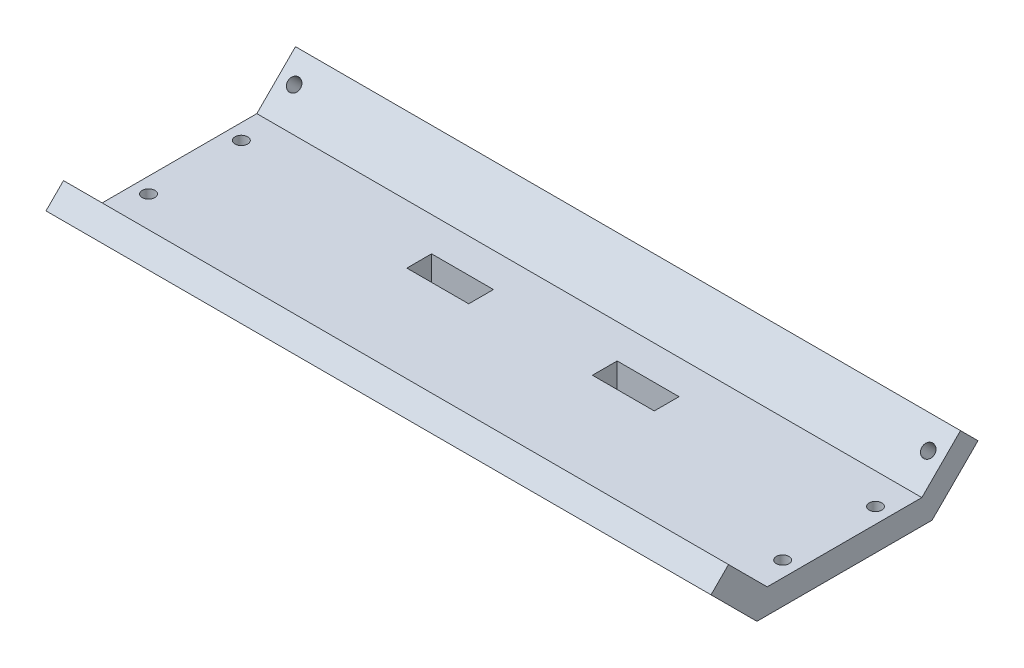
ISO-10303-21;
HEADER;
FILE_DESCRIPTION(('STEP AP214'),'2;1');
FILE_NAME('part.step','',(''),(''),'','','');
FILE_SCHEMA(('AUTOMOTIVE_DESIGN { 1 0 10303 214 1 1 1 1 }'));
ENDSEC;
DATA;
#1=APPLICATION_CONTEXT('core data for automotive mechanical design processes');
#2=APPLICATION_PROTOCOL_DEFINITION('international standard','automotive_design',2000,#1);
#3=PRODUCT_CONTEXT('',#1,'mechanical');
#4=PRODUCT('Part','Part','',(#3));
#5=PRODUCT_RELATED_PRODUCT_CATEGORY('part','',(#4));
#6=PRODUCT_DEFINITION_FORMATION('','',#4);
#7=PRODUCT_DEFINITION_CONTEXT('part definition',#1,'design');
#8=PRODUCT_DEFINITION('design','',#6,#7);
#9=PRODUCT_DEFINITION_SHAPE('','',#8);
#10=(LENGTH_UNIT() NAMED_UNIT(*) SI_UNIT(.MILLI.,.METRE.));
#11=(NAMED_UNIT(*) PLANE_ANGLE_UNIT() SI_UNIT($,.RADIAN.));
#12=(NAMED_UNIT(*) SI_UNIT($,.STERADIAN.) SOLID_ANGLE_UNIT());
#13=UNCERTAINTY_MEASURE_WITH_UNIT(LENGTH_MEASURE(1.E-05),#10,'distance_accuracy_value','');
#14=(GEOMETRIC_REPRESENTATION_CONTEXT(3) GLOBAL_UNCERTAINTY_ASSIGNED_CONTEXT((#13)) GLOBAL_UNIT_ASSIGNED_CONTEXT((#10,
#11,#12)) REPRESENTATION_CONTEXT('',''));
#15=CARTESIAN_POINT('',(0.,0.,0.));
#16=DIRECTION('',(0.,0.,1.));
#17=DIRECTION('',(1.,0.,0.));
#18=AXIS2_PLACEMENT_3D('',#15,#16,#17);
#19=CARTESIAN_POINT('',(107.5,12.4999999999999,37.5000000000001));
#20=DIRECTION('',(0.,-0.707106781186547,-0.707106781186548));
#21=DIRECTION('',(0.,0.707106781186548,-0.707106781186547));
#22=AXIS2_PLACEMENT_3D('',#19,#20,#21);
#23=PLANE('',#22);
#24=DIRECTION('',(0.,-0.707106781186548,0.707106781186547));
#25=VECTOR('',#24,1.);
#26=CARTESIAN_POINT('',(-107.5,12.4999999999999,37.5000000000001));
#27=LINE('',#26,#25);
#28=CARTESIAN_POINT('',(-107.5,12.4999999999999,37.5000000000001));
#29=VERTEX_POINT('',#28);
#30=CARTESIAN_POINT('',(-107.5,6.84314575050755,43.1568542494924));
#31=VERTEX_POINT('',#30);
#32=EDGE_CURVE('E266',#29,#31,#27,.T.);
#33=ORIENTED_EDGE('',*,*,#32,.T.);
#34=DIRECTION('',(-1.,0.,0.));
#35=VECTOR('',#34,1.);
#36=CARTESIAN_POINT('',(107.5,6.84314575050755,43.1568542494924));
#37=LINE('',#36,#35);
#38=CARTESIAN_POINT('',(107.5,6.84314575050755,43.1568542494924));
#39=VERTEX_POINT('',#38);
#40=EDGE_CURVE('E11',#39,#31,#37,.T.);
#41=ORIENTED_EDGE('',*,*,#40,.F.);
#42=DIRECTION('',(0.,-0.707106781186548,0.707106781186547));
#43=VECTOR('',#42,1.);
#44=CARTESIAN_POINT('',(107.5,12.4999999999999,37.5000000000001));
#45=LINE('',#44,#43);
#46=CARTESIAN_POINT('',(107.5,12.4999999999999,37.5000000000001));
#47=VERTEX_POINT('',#46);
#48=EDGE_CURVE('E267',#47,#39,#45,.T.);
#49=ORIENTED_EDGE('',*,*,#48,.F.);
#50=DIRECTION('',(-1.,0.,0.));
#51=VECTOR('',#50,1.);
#52=CARTESIAN_POINT('',(107.5,12.4999999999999,37.5000000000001));
#53=LINE('',#52,#51);
#54=EDGE_CURVE('E285',#47,#29,#53,.T.);
#55=ORIENTED_EDGE('',*,*,#54,.T.);
#56=EDGE_LOOP('',(#33,#41,#49,#55));
#57=FACE_BOUND('',#56,.T.);
#58=ADVANCED_FACE('F38',(#57),#23,.F.);
#59=CARTESIAN_POINT('',(107.5,-8.,28.313708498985));
#60=DIRECTION('',(0.,0.707106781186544,-0.707106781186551));
#61=DIRECTION('',(0.,0.707106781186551,0.707106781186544));
#62=AXIS2_PLACEMENT_3D('',#59,#60,#61);
#63=PLANE('',#62);
#64=CARTESIAN_POINT('',(-102.5,1.414213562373,37.7279220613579));
#65=DIRECTION('',(0.,0.707106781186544,-0.707106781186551));
#66=DIRECTION('',(0.,0.707106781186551,0.707106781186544));
#67=AXIS2_PLACEMENT_3D('',#64,#65,#66);
#68=CIRCLE('',#67,2.04999999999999);
#69=CARTESIAN_POINT('',(-102.5,2.86378246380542,39.1774909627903));
#70=VERTEX_POINT('',#69);
#71=EDGE_CURVE('E242',#70,#70,#68,.T.);
#72=ORIENTED_EDGE('',*,*,#71,.T.);
#73=EDGE_LOOP('',(#72));
#74=FACE_BOUND('',#73,.T.);
#75=CARTESIAN_POINT('',(102.5,1.414213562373,37.7279220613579));
#76=DIRECTION('',(0.,0.707106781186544,-0.707106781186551));
#77=DIRECTION('',(0.,0.707106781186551,0.707106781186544));
#78=AXIS2_PLACEMENT_3D('',#75,#76,#77);
#79=CIRCLE('',#78,2.04999999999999);
#80=CARTESIAN_POINT('',(102.5,2.86378246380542,39.1774909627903));
#81=VERTEX_POINT('',#80);
#82=EDGE_CURVE('E41',#81,#81,#79,.T.);
#83=ORIENTED_EDGE('',*,*,#82,.T.);
#84=EDGE_LOOP('',(#83));
#85=FACE_BOUND('',#84,.T.);
#86=DIRECTION('',(0.,-0.707106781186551,-0.707106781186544));
#87=VECTOR('',#86,1.);
#88=CARTESIAN_POINT('',(-107.5,-8.,28.313708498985));
#89=LINE('',#88,#87);
#90=CARTESIAN_POINT('',(-107.5,-8.,28.313708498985));
#91=VERTEX_POINT('',#90);
#92=EDGE_CURVE('E288',#31,#91,#89,.T.);
#93=ORIENTED_EDGE('',*,*,#92,.T.);
#94=DIRECTION('',(-1.,0.,0.));
#95=VECTOR('',#94,1.);
#96=CARTESIAN_POINT('',(107.5,-8.,28.313708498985));
#97=LINE('',#96,#95);
#98=CARTESIAN_POINT('',(107.5,-8.,28.313708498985));
#99=VERTEX_POINT('',#98);
#100=EDGE_CURVE('E46',#99,#91,#97,.T.);
#101=ORIENTED_EDGE('',*,*,#100,.F.);
#102=DIRECTION('',(0.,-0.707106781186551,-0.707106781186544));
#103=VECTOR('',#102,1.);
#104=CARTESIAN_POINT('',(107.5,-8.,28.313708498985));
#105=LINE('',#104,#103);
#106=EDGE_CURVE('E270',#39,#99,#105,.T.);
#107=ORIENTED_EDGE('',*,*,#106,.F.);
#108=ORIENTED_EDGE('',*,*,#40,.T.);
#109=EDGE_LOOP('',(#93,#101,#107,#108));
#110=FACE_BOUND('',#109,.T.);
#111=ADVANCED_FACE('F345',(#74,#85,#110),#63,.F.);
#112=CARTESIAN_POINT('',(107.5,-8.,28.313708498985));
#113=DIRECTION('',(0.,1.,0.));
#114=DIRECTION('',(0.,0.,1.));
#115=AXIS2_PLACEMENT_3D('',#112,#113,#114);
#116=PLANE('',#115);
#117=DIRECTION('',(1.,0.,0.));
#118=VECTOR('',#117,1.);
#119=CARTESIAN_POINT('',(20.,-8.,-6.));
#120=LINE('',#119,#118);
#121=CARTESIAN_POINT('',(20.,-8.,-6.));
#122=VERTEX_POINT('',#121);
#123=CARTESIAN_POINT('',(40.,-8.,-6.));
#124=VERTEX_POINT('',#123);
#125=EDGE_CURVE('E163',#122,#124,#120,.T.);
#126=ORIENTED_EDGE('',*,*,#125,.T.);
#127=DIRECTION('',(0.,0.,-1.));
#128=VECTOR('',#127,1.);
#129=CARTESIAN_POINT('',(40.,-8.,-14.));
#130=LINE('',#129,#128);
#131=CARTESIAN_POINT('',(40.,-8.,-14.));
#132=VERTEX_POINT('',#131);
#133=EDGE_CURVE('E155',#124,#132,#130,.T.);
#134=ORIENTED_EDGE('',*,*,#133,.T.);
#135=DIRECTION('',(-1.,0.,0.));
#136=VECTOR('',#135,1.);
#137=CARTESIAN_POINT('',(20.,-8.,-14.));
#138=LINE('',#137,#136);
#139=CARTESIAN_POINT('',(20.,-8.,-14.));
#140=VERTEX_POINT('',#139);
#141=EDGE_CURVE('E166',#132,#140,#138,.T.);
#142=ORIENTED_EDGE('',*,*,#141,.T.);
#143=DIRECTION('',(0.,0.,1.));
#144=VECTOR('',#143,1.);
#145=CARTESIAN_POINT('',(20.,-8.,-14.));
#146=LINE('',#145,#144);
#147=EDGE_CURVE('E53',#140,#122,#146,.T.);
#148=ORIENTED_EDGE('',*,*,#147,.T.);
#149=EDGE_LOOP('',(#126,#134,#142,#148));
#150=FACE_BOUND('',#149,.T.);
#151=DIRECTION('',(1.,0.,0.));
#152=VECTOR('',#151,1.);
#153=CARTESIAN_POINT('',(-40.,-8.,-6.));
#154=LINE('',#153,#152);
#155=CARTESIAN_POINT('',(-40.,-8.,-6.));
#156=VERTEX_POINT('',#155);
#157=CARTESIAN_POINT('',(-20.,-8.,-6.));
#158=VERTEX_POINT('',#157);
#159=EDGE_CURVE('E196',#156,#158,#154,.T.);
#160=ORIENTED_EDGE('',*,*,#159,.T.);
#161=DIRECTION('',(0.,0.,-1.));
#162=VECTOR('',#161,1.);
#163=CARTESIAN_POINT('',(-20.,-8.,-14.));
#164=LINE('',#163,#162);
#165=CARTESIAN_POINT('',(-20.,-8.,-14.));
#166=VERTEX_POINT('',#165);
#167=EDGE_CURVE('E207',#158,#166,#164,.T.);
#168=ORIENTED_EDGE('',*,*,#167,.T.);
#169=DIRECTION('',(-1.,0.,0.));
#170=VECTOR('',#169,1.);
#171=CARTESIAN_POINT('',(-40.,-8.,-14.));
#172=LINE('',#171,#170);
#173=CARTESIAN_POINT('',(-40.,-8.,-14.));
#174=VERTEX_POINT('',#173);
#175=EDGE_CURVE('E217',#166,#174,#172,.T.);
#176=ORIENTED_EDGE('',*,*,#175,.T.);
#177=DIRECTION('',(0.,0.,1.));
#178=VECTOR('',#177,1.);
#179=CARTESIAN_POINT('',(-40.,-8.,-14.));
#180=LINE('',#179,#178);
#181=EDGE_CURVE('E61',#174,#156,#180,.T.);
#182=ORIENTED_EDGE('',*,*,#181,.T.);
#183=EDGE_LOOP('',(#160,#168,#176,#182));
#184=FACE_BOUND('',#183,.T.);
#185=CARTESIAN_POINT('',(-102.5,-8.,-15.0000000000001));
#186=DIRECTION('',(0.,1.,0.));
#187=DIRECTION('',(0.,0.,1.));
#188=AXIS2_PLACEMENT_3D('',#185,#186,#187);
#189=CIRCLE('',#188,2.05);
#190=CARTESIAN_POINT('',(-102.5,-8.,-12.9500000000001));
#191=VERTEX_POINT('',#190);
#192=EDGE_CURVE('E230',#191,#191,#189,.T.);
#193=ORIENTED_EDGE('',*,*,#192,.T.);
#194=EDGE_LOOP('',(#193));
#195=FACE_BOUND('',#194,.T.);
#196=CARTESIAN_POINT('',(-102.5,-8.,15.0000000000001));
#197=DIRECTION('',(0.,1.,0.));
#198=DIRECTION('',(0.,0.,1.));
#199=AXIS2_PLACEMENT_3D('',#196,#197,#198);
#200=CIRCLE('',#199,2.05);
#201=CARTESIAN_POINT('',(-102.5,-8.,17.0500000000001));
#202=VERTEX_POINT('',#201);
#203=EDGE_CURVE('E236',#202,#202,#200,.T.);
#204=ORIENTED_EDGE('',*,*,#203,.T.);
#205=EDGE_LOOP('',(#204));
#206=FACE_BOUND('',#205,.T.);
#207=CARTESIAN_POINT('',(102.5,-8.,15.0000000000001));
#208=DIRECTION('',(0.,1.,0.));
#209=DIRECTION('',(0.,0.,1.));
#210=AXIS2_PLACEMENT_3D('',#207,#208,#209);
#211=CIRCLE('',#210,2.05);
#212=CARTESIAN_POINT('',(102.5,-8.,17.0500000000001));
#213=VERTEX_POINT('',#212);
#214=EDGE_CURVE('E251',#213,#213,#211,.T.);
#215=ORIENTED_EDGE('',*,*,#214,.T.);
#216=EDGE_LOOP('',(#215));
#217=FACE_BOUND('',#216,.T.);
#218=CARTESIAN_POINT('',(102.5,-8.,-15.0000000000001));
#219=DIRECTION('',(0.,1.,0.));
#220=DIRECTION('',(0.,0.,1.));
#221=AXIS2_PLACEMENT_3D('',#218,#219,#220);
#222=CIRCLE('',#221,2.05);
#223=CARTESIAN_POINT('',(102.5,-8.,-12.9500000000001));
#224=VERTEX_POINT('',#223);
#225=EDGE_CURVE('E257',#224,#224,#222,.T.);
#226=ORIENTED_EDGE('',*,*,#225,.T.);
#227=EDGE_LOOP('',(#226));
#228=FACE_BOUND('',#227,.T.);
#229=DIRECTION('',(0.,0.,-1.));
#230=VECTOR('',#229,1.);
#231=CARTESIAN_POINT('',(-107.5,-8.,28.313708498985));
#232=LINE('',#231,#230);
#233=CARTESIAN_POINT('',(-107.5,-8.,-28.3137084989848));
#234=VERTEX_POINT('',#233);
#235=EDGE_CURVE('E290',#91,#234,#232,.T.);
#236=ORIENTED_EDGE('',*,*,#235,.T.);
#237=DIRECTION('',(-1.,0.,0.));
#238=VECTOR('',#237,1.);
#239=CARTESIAN_POINT('',(107.5,-8.,-28.3137084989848));
#240=LINE('',#239,#238);
#241=CARTESIAN_POINT('',(107.5,-8.,-28.3137084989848));
#242=VERTEX_POINT('',#241);
#243=EDGE_CURVE('E315',#242,#234,#240,.T.);
#244=ORIENTED_EDGE('',*,*,#243,.F.);
#245=DIRECTION('',(0.,0.,-1.));
#246=VECTOR('',#245,1.);
#247=CARTESIAN_POINT('',(107.5,-8.,28.313708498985));
#248=LINE('',#247,#246);
#249=EDGE_CURVE('E273',#99,#242,#248,.T.);
#250=ORIENTED_EDGE('',*,*,#249,.F.);
#251=ORIENTED_EDGE('',*,*,#100,.T.);
#252=EDGE_LOOP('',(#236,#244,#250,#251));
#253=FACE_BOUND('',#252,.T.);
#254=ADVANCED_FACE('F170',(#150,#184,#195,#206,#217,#228,#253),#116,.F.);
#255=CARTESIAN_POINT('',(107.5,-8.,-28.3137084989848));
#256=DIRECTION('',(0.,0.707106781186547,0.707106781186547));
#257=DIRECTION('',(0.,-0.707106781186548,0.707106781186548));
#258=AXIS2_PLACEMENT_3D('',#255,#256,#257);
#259=PLANE('',#258);
#260=CARTESIAN_POINT('',(-102.5,1.41421356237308,-37.7279220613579));
#261=DIRECTION('',(0.,0.707106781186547,0.707106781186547));
#262=DIRECTION('',(0.,-0.707106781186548,0.707106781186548));
#263=AXIS2_PLACEMENT_3D('',#260,#261,#262);
#264=CIRCLE('',#263,2.04999999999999);
#265=CARTESIAN_POINT('',(-102.5,-0.0353553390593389,-36.2783531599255));
#266=VERTEX_POINT('',#265);
#267=EDGE_CURVE('E224',#266,#266,#264,.T.);
#268=ORIENTED_EDGE('',*,*,#267,.T.);
#269=EDGE_LOOP('',(#268));
#270=FACE_BOUND('',#269,.T.);
#271=CARTESIAN_POINT('',(102.5,1.41421356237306,-37.7279220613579));
#272=DIRECTION('',(0.,0.707106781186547,0.707106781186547));
#273=DIRECTION('',(0.,-0.707106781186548,0.707106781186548));
#274=AXIS2_PLACEMENT_3D('',#271,#272,#273);
#275=CIRCLE('',#274,2.04999999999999);
#276=CARTESIAN_POINT('',(102.5,-0.0353553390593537,-36.2783531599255));
#277=VERTEX_POINT('',#276);
#278=EDGE_CURVE('E263',#277,#277,#275,.T.);
#279=ORIENTED_EDGE('',*,*,#278,.T.);
#280=EDGE_LOOP('',(#279));
#281=FACE_BOUND('',#280,.T.);
#282=DIRECTION('',(0.,0.707106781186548,-0.707106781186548));
#283=VECTOR('',#282,1.);
#284=CARTESIAN_POINT('',(-107.5,-8.,-28.3137084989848));
#285=LINE('',#284,#283);
#286=CARTESIAN_POINT('',(-107.5,6.84314575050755,-43.1568542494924));
#287=VERTEX_POINT('',#286);
#288=EDGE_CURVE('E292',#234,#287,#285,.T.);
#289=ORIENTED_EDGE('',*,*,#288,.T.);
#290=DIRECTION('',(-1.,0.,0.));
#291=VECTOR('',#290,1.);
#292=CARTESIAN_POINT('',(107.5,6.84314575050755,-43.1568542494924));
#293=LINE('',#292,#291);
#294=CARTESIAN_POINT('',(107.5,6.84314575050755,-43.1568542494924));
#295=VERTEX_POINT('',#294);
#296=EDGE_CURVE('E312',#295,#287,#293,.T.);
#297=ORIENTED_EDGE('',*,*,#296,.F.);
#298=DIRECTION('',(0.,0.707106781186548,-0.707106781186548));
#299=VECTOR('',#298,1.);
#300=CARTESIAN_POINT('',(107.5,-8.,-28.3137084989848));
#301=LINE('',#300,#299);
#302=EDGE_CURVE('E275',#242,#295,#301,.T.);
#303=ORIENTED_EDGE('',*,*,#302,.F.);
#304=ORIENTED_EDGE('',*,*,#243,.T.);
#305=EDGE_LOOP('',(#289,#297,#303,#304));
#306=FACE_BOUND('',#305,.T.);
#307=ADVANCED_FACE('F333',(#270,#281,#306),#259,.F.);
#308=CARTESIAN_POINT('',(107.5,12.5,-37.5));
#309=DIRECTION('',(0.,-0.707106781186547,0.707106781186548));
#310=DIRECTION('',(0.,-0.707106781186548,-0.707106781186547));
#311=AXIS2_PLACEMENT_3D('',#308,#309,#310);
#312=PLANE('',#311);
#313=DIRECTION('',(0.,0.707106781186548,0.707106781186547));
#314=VECTOR('',#313,1.);
#315=CARTESIAN_POINT('',(-107.5,12.5,-37.5));
#316=LINE('',#315,#314);
#317=CARTESIAN_POINT('',(-107.5,12.5,-37.5));
#318=VERTEX_POINT('',#317);
#319=EDGE_CURVE('E294',#287,#318,#316,.T.);
#320=ORIENTED_EDGE('',*,*,#319,.T.);
#321=DIRECTION('',(-1.,0.,0.));
#322=VECTOR('',#321,1.);
#323=CARTESIAN_POINT('',(107.5,12.5,-37.5));
#324=LINE('',#323,#322);
#325=CARTESIAN_POINT('',(107.5,12.5,-37.5));
#326=VERTEX_POINT('',#325);
#327=EDGE_CURVE('E309',#326,#318,#324,.T.);
#328=ORIENTED_EDGE('',*,*,#327,.F.);
#329=DIRECTION('',(0.,0.707106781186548,0.707106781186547));
#330=VECTOR('',#329,1.);
#331=CARTESIAN_POINT('',(107.5,12.5,-37.5));
#332=LINE('',#331,#330);
#333=EDGE_CURVE('E277',#295,#326,#332,.T.);
#334=ORIENTED_EDGE('',*,*,#333,.F.);
#335=ORIENTED_EDGE('',*,*,#296,.T.);
#336=EDGE_LOOP('',(#320,#328,#334,#335));
#337=FACE_BOUND('',#336,.T.);
#338=ADVANCED_FACE('F337',(#337),#312,.F.);
#339=CARTESIAN_POINT('',(107.5,0.,-25.0000000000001));
#340=DIRECTION('',(0.,-0.707106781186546,-0.707106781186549));
#341=DIRECTION('',(0.,0.707106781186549,-0.707106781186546));
#342=AXIS2_PLACEMENT_3D('',#339,#340,#341);
#343=PLANE('',#342);
#344=CARTESIAN_POINT('',(-102.5,7.07106781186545,-32.0710678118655));
#345=DIRECTION('',(0.,0.707106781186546,0.707106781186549));
#346=DIRECTION('',(0.,-0.707106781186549,0.707106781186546));
#347=AXIS2_PLACEMENT_3D('',#344,#345,#346);
#348=CIRCLE('',#347,2.04999999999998);
#349=CARTESIAN_POINT('',(-102.5,5.62149891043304,-30.6214989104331));
#350=VERTEX_POINT('',#349);
#351=EDGE_CURVE('E189',#350,#350,#348,.T.);
#352=ORIENTED_EDGE('',*,*,#351,.F.);
#353=EDGE_LOOP('',(#352));
#354=FACE_BOUND('',#353,.T.);
#355=CARTESIAN_POINT('',(102.5,7.07106781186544,-32.0710678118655));
#356=DIRECTION('',(0.,0.707106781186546,0.707106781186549));
#357=DIRECTION('',(0.,-0.707106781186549,0.707106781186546));
#358=AXIS2_PLACEMENT_3D('',#355,#356,#357);
#359=CIRCLE('',#358,2.04999999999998);
#360=CARTESIAN_POINT('',(102.5,5.62149891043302,-30.6214989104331));
#361=VERTEX_POINT('',#360);
#362=EDGE_CURVE('E260',#361,#361,#359,.T.);
#363=ORIENTED_EDGE('',*,*,#362,.F.);
#364=EDGE_LOOP('',(#363));
#365=FACE_BOUND('',#364,.T.);
#366=DIRECTION('',(0.,-0.707106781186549,0.707106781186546));
#367=VECTOR('',#366,1.);
#368=CARTESIAN_POINT('',(-107.5,0.,-25.0000000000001));
#369=LINE('',#368,#367);
#370=CARTESIAN_POINT('',(-107.5,0.,-25.0000000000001));
#371=VERTEX_POINT('',#370);
#372=EDGE_CURVE('E296',#318,#371,#369,.T.);
#373=ORIENTED_EDGE('',*,*,#372,.T.);
#374=DIRECTION('',(-1.,0.,0.));
#375=VECTOR('',#374,1.);
#376=CARTESIAN_POINT('',(107.5,0.,-25.0000000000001));
#377=LINE('',#376,#375);
#378=CARTESIAN_POINT('',(107.5,0.,-25.0000000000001));
#379=VERTEX_POINT('',#378);
#380=EDGE_CURVE('E306',#379,#371,#377,.T.);
#381=ORIENTED_EDGE('',*,*,#380,.F.);
#382=DIRECTION('',(0.,-0.707106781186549,0.707106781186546));
#383=VECTOR('',#382,1.);
#384=CARTESIAN_POINT('',(107.5,0.,-25.0000000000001));
#385=LINE('',#384,#383);
#386=EDGE_CURVE('E279',#326,#379,#385,.T.);
#387=ORIENTED_EDGE('',*,*,#386,.F.);
#388=ORIENTED_EDGE('',*,*,#327,.T.);
#389=EDGE_LOOP('',(#373,#381,#387,#388));
#390=FACE_BOUND('',#389,.T.);
#391=ADVANCED_FACE('F358',(#354,#365,#390),#343,.F.);
#392=CARTESIAN_POINT('',(107.5,0.,25.0000000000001));
#393=DIRECTION('',(0.,-1.,0.));
#394=DIRECTION('',(0.,0.,-1.));
#395=AXIS2_PLACEMENT_3D('',#392,#393,#394);
#396=PLANE('',#395);
#397=DIRECTION('',(-1.,0.,0.));
#398=VECTOR('',#397,1.);
#399=CARTESIAN_POINT('',(20.,0.,-14.));
#400=LINE('',#399,#398);
#401=CARTESIAN_POINT('',(40.,0.,-14.));
#402=VERTEX_POINT('',#401);
#403=CARTESIAN_POINT('',(20.,0.,-14.));
#404=VERTEX_POINT('',#403);
#405=EDGE_CURVE('E182',#402,#404,#400,.T.);
#406=ORIENTED_EDGE('',*,*,#405,.F.);
#407=DIRECTION('',(0.,0.,-1.));
#408=VECTOR('',#407,1.);
#409=CARTESIAN_POINT('',(40.,0.,-14.));
#410=LINE('',#409,#408);
#411=CARTESIAN_POINT('',(40.,0.,-6.));
#412=VERTEX_POINT('',#411);
#413=EDGE_CURVE('E158',#412,#402,#410,.T.);
#414=ORIENTED_EDGE('',*,*,#413,.F.);
#415=DIRECTION('',(1.,0.,0.));
#416=VECTOR('',#415,1.);
#417=CARTESIAN_POINT('',(20.,0.,-6.));
#418=LINE('',#417,#416);
#419=CARTESIAN_POINT('',(20.,0.,-6.));
#420=VERTEX_POINT('',#419);
#421=EDGE_CURVE('E173',#420,#412,#418,.T.);
#422=ORIENTED_EDGE('',*,*,#421,.F.);
#423=DIRECTION('',(0.,0.,1.));
#424=VECTOR('',#423,1.);
#425=CARTESIAN_POINT('',(20.,0.,-14.));
#426=LINE('',#425,#424);
#427=EDGE_CURVE('E176',#404,#420,#426,.T.);
#428=ORIENTED_EDGE('',*,*,#427,.F.);
#429=EDGE_LOOP('',(#406,#414,#422,#428));
#430=FACE_BOUND('',#429,.T.);
#431=DIRECTION('',(-1.,0.,0.));
#432=VECTOR('',#431,1.);
#433=CARTESIAN_POINT('',(-40.,0.,-14.));
#434=LINE('',#433,#432);
#435=CARTESIAN_POINT('',(-20.,0.,-14.));
#436=VERTEX_POINT('',#435);
#437=CARTESIAN_POINT('',(-40.,0.,-14.));
#438=VERTEX_POINT('',#437);
#439=EDGE_CURVE('E210',#436,#438,#434,.T.);
#440=ORIENTED_EDGE('',*,*,#439,.F.);
#441=DIRECTION('',(0.,0.,-1.));
#442=VECTOR('',#441,1.);
#443=CARTESIAN_POINT('',(-20.,0.,-14.));
#444=LINE('',#443,#442);
#445=CARTESIAN_POINT('',(-20.,0.,-6.));
#446=VERTEX_POINT('',#445);
#447=EDGE_CURVE('E183',#446,#436,#444,.T.);
#448=ORIENTED_EDGE('',*,*,#447,.F.);
#449=DIRECTION('',(1.,0.,0.));
#450=VECTOR('',#449,1.);
#451=CARTESIAN_POINT('',(-40.,0.,-6.));
#452=LINE('',#451,#450);
#453=CARTESIAN_POINT('',(-40.,0.,-6.));
#454=VERTEX_POINT('',#453);
#455=EDGE_CURVE('E203',#454,#446,#452,.T.);
#456=ORIENTED_EDGE('',*,*,#455,.F.);
#457=DIRECTION('',(0.,0.,1.));
#458=VECTOR('',#457,1.);
#459=CARTESIAN_POINT('',(-40.,0.,-14.));
#460=LINE('',#459,#458);
#461=EDGE_CURVE('E206',#438,#454,#460,.T.);
#462=ORIENTED_EDGE('',*,*,#461,.F.);
#463=EDGE_LOOP('',(#440,#448,#456,#462));
#464=FACE_BOUND('',#463,.T.);
#465=CARTESIAN_POINT('',(-102.5,0.,-15.0000000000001));
#466=DIRECTION('',(0.,1.,0.));
#467=DIRECTION('',(0.,0.,1.));
#468=AXIS2_PLACEMENT_3D('',#465,#466,#467);
#469=CIRCLE('',#468,2.04999999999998);
#470=CARTESIAN_POINT('',(-102.5,0.,-12.9500000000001));
#471=VERTEX_POINT('',#470);
#472=EDGE_CURVE('E227',#471,#471,#469,.T.);
#473=ORIENTED_EDGE('',*,*,#472,.F.);
#474=EDGE_LOOP('',(#473));
#475=FACE_BOUND('',#474,.T.);
#476=CARTESIAN_POINT('',(-102.5,0.,15.0000000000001));
#477=DIRECTION('',(0.,1.,0.));
#478=DIRECTION('',(0.,0.,1.));
#479=AXIS2_PLACEMENT_3D('',#476,#477,#478);
#480=CIRCLE('',#479,2.04999999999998);
#481=CARTESIAN_POINT('',(-102.5,0.,17.0500000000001));
#482=VERTEX_POINT('',#481);
#483=EDGE_CURVE('E233',#482,#482,#480,.T.);
#484=ORIENTED_EDGE('',*,*,#483,.F.);
#485=EDGE_LOOP('',(#484));
#486=FACE_BOUND('',#485,.T.);
#487=CARTESIAN_POINT('',(102.5,0.,15.0000000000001));
#488=DIRECTION('',(0.,1.,0.));
#489=DIRECTION('',(0.,0.,1.));
#490=AXIS2_PLACEMENT_3D('',#487,#488,#489);
#491=CIRCLE('',#490,2.04999999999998);
#492=CARTESIAN_POINT('',(102.5,0.,17.0500000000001));
#493=VERTEX_POINT('',#492);
#494=EDGE_CURVE('E248',#493,#493,#491,.T.);
#495=ORIENTED_EDGE('',*,*,#494,.F.);
#496=EDGE_LOOP('',(#495));
#497=FACE_BOUND('',#496,.T.);
#498=CARTESIAN_POINT('',(102.5,0.,-15.0000000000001));
#499=DIRECTION('',(0.,1.,0.));
#500=DIRECTION('',(0.,0.,1.));
#501=AXIS2_PLACEMENT_3D('',#498,#499,#500);
#502=CIRCLE('',#501,2.04999999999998);
#503=CARTESIAN_POINT('',(102.5,0.,-12.9500000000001));
#504=VERTEX_POINT('',#503);
#505=EDGE_CURVE('E254',#504,#504,#502,.T.);
#506=ORIENTED_EDGE('',*,*,#505,.F.);
#507=EDGE_LOOP('',(#506));
#508=FACE_BOUND('',#507,.T.);
#509=DIRECTION('',(0.,0.,1.));
#510=VECTOR('',#509,1.);
#511=CARTESIAN_POINT('',(-107.5,0.,25.0000000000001));
#512=LINE('',#511,#510);
#513=CARTESIAN_POINT('',(-107.5,0.,25.0000000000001));
#514=VERTEX_POINT('',#513);
#515=EDGE_CURVE('E298',#371,#514,#512,.T.);
#516=ORIENTED_EDGE('',*,*,#515,.T.);
#517=DIRECTION('',(-1.,0.,0.));
#518=VECTOR('',#517,1.);
#519=CARTESIAN_POINT('',(107.5,0.,25.0000000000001));
#520=LINE('',#519,#518);
#521=CARTESIAN_POINT('',(107.5,0.,25.0000000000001));
#522=VERTEX_POINT('',#521);
#523=EDGE_CURVE('E303',#522,#514,#520,.T.);
#524=ORIENTED_EDGE('',*,*,#523,.F.);
#525=DIRECTION('',(0.,0.,1.));
#526=VECTOR('',#525,1.);
#527=CARTESIAN_POINT('',(107.5,0.,25.0000000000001));
#528=LINE('',#527,#526);
#529=EDGE_CURVE('E281',#379,#522,#528,.T.);
#530=ORIENTED_EDGE('',*,*,#529,.F.);
#531=ORIENTED_EDGE('',*,*,#380,.T.);
#532=EDGE_LOOP('',(#516,#524,#530,#531));
#533=FACE_BOUND('',#532,.T.);
#534=ADVANCED_FACE('F356',(#430,#464,#475,#486,#497,#508,#533),#396,.F.);
#535=CARTESIAN_POINT('',(107.5,0.,25.0000000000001));
#536=DIRECTION('',(0.,-0.707106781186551,0.707106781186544));
#537=DIRECTION('',(0.,-0.707106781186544,-0.707106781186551));
#538=AXIS2_PLACEMENT_3D('',#535,#536,#537);
#539=PLANE('',#538);
#540=CARTESIAN_POINT('',(-102.5,7.0710678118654,32.0710678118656));
#541=DIRECTION('',(0.,0.707106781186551,-0.707106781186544));
#542=DIRECTION('',(0.,0.707106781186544,0.707106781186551));
#543=AXIS2_PLACEMENT_3D('',#540,#541,#542);
#544=CIRCLE('',#543,2.04999999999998);
#545=CARTESIAN_POINT('',(-102.5,8.5206367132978,33.520636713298));
#546=VERTEX_POINT('',#545);
#547=EDGE_CURVE('E239',#546,#546,#544,.T.);
#548=ORIENTED_EDGE('',*,*,#547,.F.);
#549=EDGE_LOOP('',(#548));
#550=FACE_BOUND('',#549,.T.);
#551=CARTESIAN_POINT('',(102.5,7.0710678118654,32.0710678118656));
#552=DIRECTION('',(0.,0.707106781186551,-0.707106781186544));
#553=DIRECTION('',(0.,0.707106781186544,0.707106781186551));
#554=AXIS2_PLACEMENT_3D('',#551,#552,#553);
#555=CIRCLE('',#554,2.04999999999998);
#556=CARTESIAN_POINT('',(102.5,8.5206367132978,33.520636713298));
#557=VERTEX_POINT('',#556);
#558=EDGE_CURVE('E245',#557,#557,#555,.T.);
#559=ORIENTED_EDGE('',*,*,#558,.F.);
#560=EDGE_LOOP('',(#559));
#561=FACE_BOUND('',#560,.T.);
#562=DIRECTION('',(0.,0.707106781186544,0.707106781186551));
#563=VECTOR('',#562,1.);
#564=CARTESIAN_POINT('',(-107.5,0.,25.0000000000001));
#565=LINE('',#564,#563);
#566=EDGE_CURVE('E271',#514,#29,#565,.T.);
#567=ORIENTED_EDGE('',*,*,#566,.T.);
#568=ORIENTED_EDGE('',*,*,#54,.F.);
#569=DIRECTION('',(0.,0.707106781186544,0.707106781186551));
#570=VECTOR('',#569,1.);
#571=CARTESIAN_POINT('',(107.5,0.,25.0000000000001));
#572=LINE('',#571,#570);
#573=EDGE_CURVE('E283',#522,#47,#572,.T.);
#574=ORIENTED_EDGE('',*,*,#573,.F.);
#575=ORIENTED_EDGE('',*,*,#523,.T.);
#576=EDGE_LOOP('',(#567,#568,#574,#575));
#577=FACE_BOUND('',#576,.T.);
#578=ADVANCED_FACE('F351',(#550,#561,#577),#539,.F.);
#579=CARTESIAN_POINT('',(107.5,0.,0.));
#580=DIRECTION('',(-1.,0.,0.));
#581=DIRECTION('',(0.,0.,1.));
#582=AXIS2_PLACEMENT_3D('',#579,#580,#581);
#583=PLANE('',#582);
#584=ORIENTED_EDGE('',*,*,#48,.T.);
#585=ORIENTED_EDGE('',*,*,#106,.T.);
#586=ORIENTED_EDGE('',*,*,#249,.T.);
#587=ORIENTED_EDGE('',*,*,#302,.T.);
#588=ORIENTED_EDGE('',*,*,#333,.T.);
#589=ORIENTED_EDGE('',*,*,#386,.T.);
#590=ORIENTED_EDGE('',*,*,#529,.T.);
#591=ORIENTED_EDGE('',*,*,#573,.T.);
#592=EDGE_LOOP('',(#584,#585,#586,#587,#588,#589,#590,#591));
#593=FACE_BOUND('',#592,.T.);
#594=ADVANCED_FACE('F341',(#593),#583,.F.);
#595=CARTESIAN_POINT('',(-107.5,0.,0.));
#596=DIRECTION('',(-1.,0.,0.));
#597=DIRECTION('',(0.,0.,1.));
#598=AXIS2_PLACEMENT_3D('',#595,#596,#597);
#599=PLANE('',#598);
#600=ORIENTED_EDGE('',*,*,#32,.F.);
#601=ORIENTED_EDGE('',*,*,#566,.F.);
#602=ORIENTED_EDGE('',*,*,#515,.F.);
#603=ORIENTED_EDGE('',*,*,#372,.F.);
#604=ORIENTED_EDGE('',*,*,#319,.F.);
#605=ORIENTED_EDGE('',*,*,#288,.F.);
#606=ORIENTED_EDGE('',*,*,#235,.F.);
#607=ORIENTED_EDGE('',*,*,#92,.F.);
#608=EDGE_LOOP('',(#600,#601,#602,#603,#604,#605,#606,#607));
#609=FACE_BOUND('',#608,.T.);
#610=ADVANCED_FACE('F328',(#609),#599,.T.);
#611=CARTESIAN_POINT('',(102.5,7.07106781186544,-32.0710678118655));
#612=DIRECTION('',(0.,0.707106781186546,0.707106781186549));
#613=DIRECTION('',(0.,-0.707106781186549,0.707106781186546));
#614=AXIS2_PLACEMENT_3D('',#611,#612,#613);
#615=CYLINDRICAL_SURFACE('',#614,2.04999999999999);
#616=ORIENTED_EDGE('',*,*,#362,.T.);
#617=EDGE_LOOP('',(#616));
#618=FACE_BOUND('',#617,.T.);
#619=ORIENTED_EDGE('',*,*,#278,.F.);
#620=EDGE_LOOP('',(#619));
#621=FACE_BOUND('',#620,.T.);
#622=ADVANCED_FACE('F392',(#618,#621),#615,.F.);
#623=CARTESIAN_POINT('',(102.5,0.,-15.0000000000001));
#624=DIRECTION('',(0.,1.,0.));
#625=DIRECTION('',(0.,0.,1.));
#626=AXIS2_PLACEMENT_3D('',#623,#624,#625);
#627=CYLINDRICAL_SURFACE('',#626,2.04999999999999);
#628=ORIENTED_EDGE('',*,*,#225,.F.);
#629=EDGE_LOOP('',(#628));
#630=FACE_BOUND('',#629,.T.);
#631=ORIENTED_EDGE('',*,*,#505,.T.);
#632=EDGE_LOOP('',(#631));
#633=FACE_BOUND('',#632,.T.);
#634=ADVANCED_FACE('F394',(#630,#633),#627,.F.);
#635=CARTESIAN_POINT('',(102.5,0.,15.0000000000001));
#636=DIRECTION('',(0.,1.,0.));
#637=DIRECTION('',(0.,0.,1.));
#638=AXIS2_PLACEMENT_3D('',#635,#636,#637);
#639=CYLINDRICAL_SURFACE('',#638,2.04999999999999);
#640=ORIENTED_EDGE('',*,*,#214,.F.);
#641=EDGE_LOOP('',(#640));
#642=FACE_BOUND('',#641,.T.);
#643=ORIENTED_EDGE('',*,*,#494,.T.);
#644=EDGE_LOOP('',(#643));
#645=FACE_BOUND('',#644,.T.);
#646=ADVANCED_FACE('F400',(#642,#645),#639,.F.);
#647=CARTESIAN_POINT('',(102.5,7.0710678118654,32.0710678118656));
#648=DIRECTION('',(0.,0.707106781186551,-0.707106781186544));
#649=DIRECTION('',(0.,0.707106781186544,0.707106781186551));
#650=AXIS2_PLACEMENT_3D('',#647,#648,#649);
#651=CYLINDRICAL_SURFACE('',#650,2.04999999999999);
#652=ORIENTED_EDGE('',*,*,#558,.T.);
#653=EDGE_LOOP('',(#652));
#654=FACE_BOUND('',#653,.T.);
#655=ORIENTED_EDGE('',*,*,#82,.F.);
#656=EDGE_LOOP('',(#655));
#657=FACE_BOUND('',#656,.T.);
#658=ADVANCED_FACE('F415',(#654,#657),#651,.F.);
#659=CARTESIAN_POINT('',(-102.5,7.0710678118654,32.0710678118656));
#660=DIRECTION('',(0.,0.707106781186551,-0.707106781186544));
#661=DIRECTION('',(0.,0.707106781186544,0.707106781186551));
#662=AXIS2_PLACEMENT_3D('',#659,#660,#661);
#663=CYLINDRICAL_SURFACE('',#662,2.04999999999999);
#664=ORIENTED_EDGE('',*,*,#547,.T.);
#665=EDGE_LOOP('',(#664));
#666=FACE_BOUND('',#665,.T.);
#667=ORIENTED_EDGE('',*,*,#71,.F.);
#668=EDGE_LOOP('',(#667));
#669=FACE_BOUND('',#668,.T.);
#670=ADVANCED_FACE('F418',(#666,#669),#663,.F.);
#671=CARTESIAN_POINT('',(-102.5,0.,15.0000000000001));
#672=DIRECTION('',(0.,1.,0.));
#673=DIRECTION('',(0.,0.,1.));
#674=AXIS2_PLACEMENT_3D('',#671,#672,#673);
#675=CYLINDRICAL_SURFACE('',#674,2.04999999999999);
#676=ORIENTED_EDGE('',*,*,#203,.F.);
#677=EDGE_LOOP('',(#676));
#678=FACE_BOUND('',#677,.T.);
#679=ORIENTED_EDGE('',*,*,#483,.T.);
#680=EDGE_LOOP('',(#679));
#681=FACE_BOUND('',#680,.T.);
#682=ADVANCED_FACE('F426',(#678,#681),#675,.F.);
#683=CARTESIAN_POINT('',(-102.5,0.,-15.0000000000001));
#684=DIRECTION('',(0.,1.,0.));
#685=DIRECTION('',(0.,0.,1.));
#686=AXIS2_PLACEMENT_3D('',#683,#684,#685);
#687=CYLINDRICAL_SURFACE('',#686,2.04999999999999);
#688=ORIENTED_EDGE('',*,*,#192,.F.);
#689=EDGE_LOOP('',(#688));
#690=FACE_BOUND('',#689,.T.);
#691=ORIENTED_EDGE('',*,*,#472,.T.);
#692=EDGE_LOOP('',(#691));
#693=FACE_BOUND('',#692,.T.);
#694=ADVANCED_FACE('F433',(#690,#693),#687,.F.);
#695=CARTESIAN_POINT('',(-102.5,7.07106781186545,-32.0710678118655));
#696=DIRECTION('',(0.,0.707106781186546,0.707106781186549));
#697=DIRECTION('',(0.,-0.707106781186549,0.707106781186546));
#698=AXIS2_PLACEMENT_3D('',#695,#696,#697);
#699=CYLINDRICAL_SURFACE('',#698,2.04999999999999);
#700=ORIENTED_EDGE('',*,*,#351,.T.);
#701=EDGE_LOOP('',(#700));
#702=FACE_BOUND('',#701,.T.);
#703=ORIENTED_EDGE('',*,*,#267,.F.);
#704=EDGE_LOOP('',(#703));
#705=FACE_BOUND('',#704,.T.);
#706=ADVANCED_FACE('F437',(#702,#705),#699,.F.);
#707=CARTESIAN_POINT('',(-20.,-8.,-14.));
#708=DIRECTION('',(1.,0.,0.));
#709=DIRECTION('',(0.,0.,-1.));
#710=AXIS2_PLACEMENT_3D('',#707,#708,#709);
#711=PLANE('',#710);
#712=ORIENTED_EDGE('',*,*,#447,.T.);
#713=DIRECTION('',(0.,1.,0.));
#714=VECTOR('',#713,1.);
#715=CARTESIAN_POINT('',(-20.,-8.,-14.));
#716=LINE('',#715,#714);
#717=EDGE_CURVE('E193',#166,#436,#716,.T.);
#718=ORIENTED_EDGE('',*,*,#717,.F.);
#719=ORIENTED_EDGE('',*,*,#167,.F.);
#720=DIRECTION('',(0.,1.,0.));
#721=VECTOR('',#720,1.);
#722=CARTESIAN_POINT('',(-20.,-8.,-6.));
#723=LINE('',#722,#721);
#724=EDGE_CURVE('E201',#158,#446,#723,.T.);
#725=ORIENTED_EDGE('',*,*,#724,.T.);
#726=EDGE_LOOP('',(#712,#718,#719,#725));
#727=FACE_BOUND('',#726,.T.);
#728=ADVANCED_FACE('F441',(#727),#711,.F.);
#729=CARTESIAN_POINT('',(-40.,-8.,-6.));
#730=DIRECTION('',(0.,0.,1.));
#731=DIRECTION('',(0.,-1.,0.));
#732=AXIS2_PLACEMENT_3D('',#729,#730,#731);
#733=PLANE('',#732);
#734=ORIENTED_EDGE('',*,*,#455,.T.);
#735=ORIENTED_EDGE('',*,*,#724,.F.);
#736=ORIENTED_EDGE('',*,*,#159,.F.);
#737=DIRECTION('',(0.,1.,0.));
#738=VECTOR('',#737,1.);
#739=CARTESIAN_POINT('',(-40.,-8.,-6.));
#740=LINE('',#739,#738);
#741=EDGE_CURVE('E199',#156,#454,#740,.T.);
#742=ORIENTED_EDGE('',*,*,#741,.T.);
#743=EDGE_LOOP('',(#734,#735,#736,#742));
#744=FACE_BOUND('',#743,.T.);
#745=ADVANCED_FACE('F443',(#744),#733,.F.);
#746=CARTESIAN_POINT('',(-40.,-8.,-14.));
#747=DIRECTION('',(-1.,0.,0.));
#748=DIRECTION('',(0.,0.,1.));
#749=AXIS2_PLACEMENT_3D('',#746,#747,#748);
#750=PLANE('',#749);
#751=ORIENTED_EDGE('',*,*,#461,.T.);
#752=ORIENTED_EDGE('',*,*,#741,.F.);
#753=ORIENTED_EDGE('',*,*,#181,.F.);
#754=DIRECTION('',(0.,1.,0.));
#755=VECTOR('',#754,1.);
#756=CARTESIAN_POINT('',(-40.,-8.,-14.));
#757=LINE('',#756,#755);
#758=EDGE_CURVE('E197',#174,#438,#757,.T.);
#759=ORIENTED_EDGE('',*,*,#758,.T.);
#760=EDGE_LOOP('',(#751,#752,#753,#759));
#761=FACE_BOUND('',#760,.T.);
#762=ADVANCED_FACE('F446',(#761),#750,.F.);
#763=CARTESIAN_POINT('',(-40.,-8.,-14.));
#764=DIRECTION('',(0.,0.,-1.));
#765=DIRECTION('',(0.,1.,0.));
#766=AXIS2_PLACEMENT_3D('',#763,#764,#765);
#767=PLANE('',#766);
#768=ORIENTED_EDGE('',*,*,#439,.T.);
#769=ORIENTED_EDGE('',*,*,#758,.F.);
#770=ORIENTED_EDGE('',*,*,#175,.F.);
#771=ORIENTED_EDGE('',*,*,#717,.T.);
#772=EDGE_LOOP('',(#768,#769,#770,#771));
#773=FACE_BOUND('',#772,.T.);
#774=ADVANCED_FACE('F450',(#773),#767,.F.);
#775=CARTESIAN_POINT('',(40.,-8.,-14.));
#776=DIRECTION('',(1.,0.,0.));
#777=DIRECTION('',(0.,0.,-1.));
#778=AXIS2_PLACEMENT_3D('',#775,#776,#777);
#779=PLANE('',#778);
#780=ORIENTED_EDGE('',*,*,#413,.T.);
#781=DIRECTION('',(0.,1.,0.));
#782=VECTOR('',#781,1.);
#783=CARTESIAN_POINT('',(40.,-8.,-14.));
#784=LINE('',#783,#782);
#785=EDGE_CURVE('E151',#132,#402,#784,.T.);
#786=ORIENTED_EDGE('',*,*,#785,.F.);
#787=ORIENTED_EDGE('',*,*,#133,.F.);
#788=DIRECTION('',(0.,1.,0.));
#789=VECTOR('',#788,1.);
#790=CARTESIAN_POINT('',(40.,-8.,-6.));
#791=LINE('',#790,#789);
#792=EDGE_CURVE('E187',#124,#412,#791,.T.);
#793=ORIENTED_EDGE('',*,*,#792,.T.);
#794=EDGE_LOOP('',(#780,#786,#787,#793));
#795=FACE_BOUND('',#794,.T.);
#796=ADVANCED_FACE('F153',(#795),#779,.F.);
#797=CARTESIAN_POINT('',(20.,-8.,-6.));
#798=DIRECTION('',(0.,0.,1.));
#799=DIRECTION('',(0.,-1.,0.));
#800=AXIS2_PLACEMENT_3D('',#797,#798,#799);
#801=PLANE('',#800);
#802=ORIENTED_EDGE('',*,*,#421,.T.);
#803=ORIENTED_EDGE('',*,*,#792,.F.);
#804=ORIENTED_EDGE('',*,*,#125,.F.);
#805=DIRECTION('',(0.,1.,0.));
#806=VECTOR('',#805,1.);
#807=CARTESIAN_POINT('',(20.,-8.,-6.));
#808=LINE('',#807,#806);
#809=EDGE_CURVE('E190',#122,#420,#808,.T.);
#810=ORIENTED_EDGE('',*,*,#809,.T.);
#811=EDGE_LOOP('',(#802,#803,#804,#810));
#812=FACE_BOUND('',#811,.T.);
#813=ADVANCED_FACE('F459',(#812),#801,.F.);
#814=CARTESIAN_POINT('',(20.,-8.,-14.));
#815=DIRECTION('',(-1.,0.,0.));
#816=DIRECTION('',(0.,0.,1.));
#817=AXIS2_PLACEMENT_3D('',#814,#815,#816);
#818=PLANE('',#817);
#819=ORIENTED_EDGE('',*,*,#427,.T.);
#820=ORIENTED_EDGE('',*,*,#809,.F.);
#821=ORIENTED_EDGE('',*,*,#147,.F.);
#822=DIRECTION('',(0.,1.,0.));
#823=VECTOR('',#822,1.);
#824=CARTESIAN_POINT('',(20.,-8.,-14.));
#825=LINE('',#824,#823);
#826=EDGE_CURVE('E162',#140,#404,#825,.T.);
#827=ORIENTED_EDGE('',*,*,#826,.T.);
#828=EDGE_LOOP('',(#819,#820,#821,#827));
#829=FACE_BOUND('',#828,.T.);
#830=ADVANCED_FACE('F462',(#829),#818,.F.);
#831=CARTESIAN_POINT('',(20.,-8.,-14.));
#832=DIRECTION('',(0.,0.,-1.));
#833=DIRECTION('',(0.,1.,0.));
#834=AXIS2_PLACEMENT_3D('',#831,#832,#833);
#835=PLANE('',#834);
#836=ORIENTED_EDGE('',*,*,#405,.T.);
#837=ORIENTED_EDGE('',*,*,#826,.F.);
#838=ORIENTED_EDGE('',*,*,#141,.F.);
#839=ORIENTED_EDGE('',*,*,#785,.T.);
#840=EDGE_LOOP('',(#836,#837,#838,#839));
#841=FACE_BOUND('',#840,.T.);
#842=ADVANCED_FACE('F167',(#841),#835,.F.);
#843=CLOSED_SHELL('',(#58,#111,#254,#307,#338,#391,#534,#578,#594,#610,#622,#634,#646,#658,#670,
#682,#694,#706,#728,#745,#762,#774,#796,#813,#830,#842));
#844=MANIFOLD_SOLID_BREP('B2',#843);
#845=ADVANCED_BREP_SHAPE_REPRESENTATION('',(#18,#844),#14);
#846=SHAPE_DEFINITION_REPRESENTATION(#9,#845);
ENDSEC;
END-ISO-10303-21;
